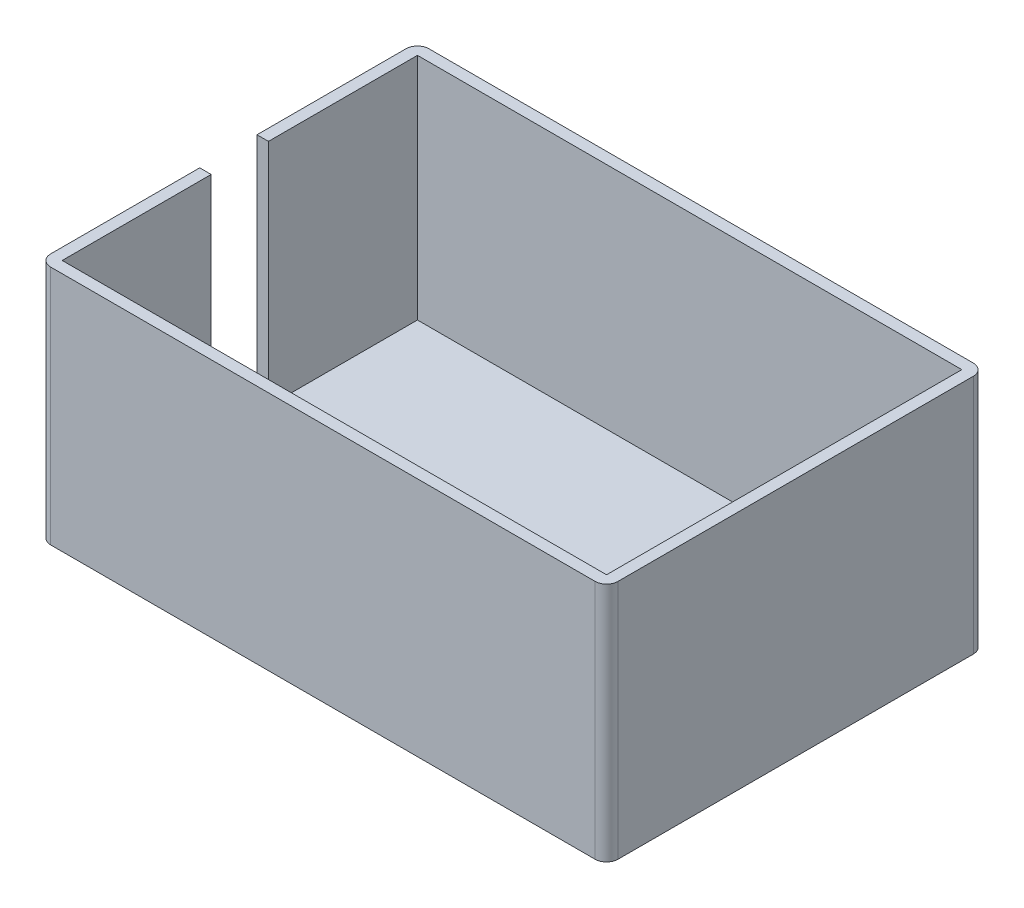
from build123d import *

# Parameters (mm, degrees)
SKETCH1_W           = 99
SKETCH1_H           = 42
BOSS_EXTRUDE1_DEPTH = 66
SHELL1_T            = -2
SKETCH2_W           = 10
SKETCH2_H           = 39.561953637
CUT_EXTRUDE1_DEPTH  = 10
FILLET1_R           = 2


with BuildPart() as part:
    # Sketch1 → Boss-Extrude1 (new body)
    with BuildSketch(Plane.XY):
        Rectangle(SKETCH1_W, SKETCH1_H)
    extrude(amount=-BOSS_EXTRUDE1_DEPTH)

    # Shell1
    shell1_openings = [part.faces().sort_by_distance(p)[0] for p in [
        (0, 21, -33),
    ]]
    offset(amount=SHELL1_T, openings=shell1_openings, kind=Kind.INTERSECTION)

    # Sketch2 → Cut-Extrude1 (cut)
    with BuildSketch(Plane.ZY.offset(49.5)):
        with Locations((-33, 1.219023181)):
            Rectangle(SKETCH2_W, SKETCH2_H)
    extrude(amount=-CUT_EXTRUDE1_DEPTH, mode=Mode.SUBTRACT)

    # Fillet1
    fillet1_edges = [part.edges().sort_by_distance(p)[0] for p in [
        (49.5, 0, -66),
        (-49.5, 0, -66),
        (49.5, 0, 0),
        (-49.5, 0, 0),
    ]]
    fillet(fillet1_edges, radius=FILLET1_R)


solid = part.part
